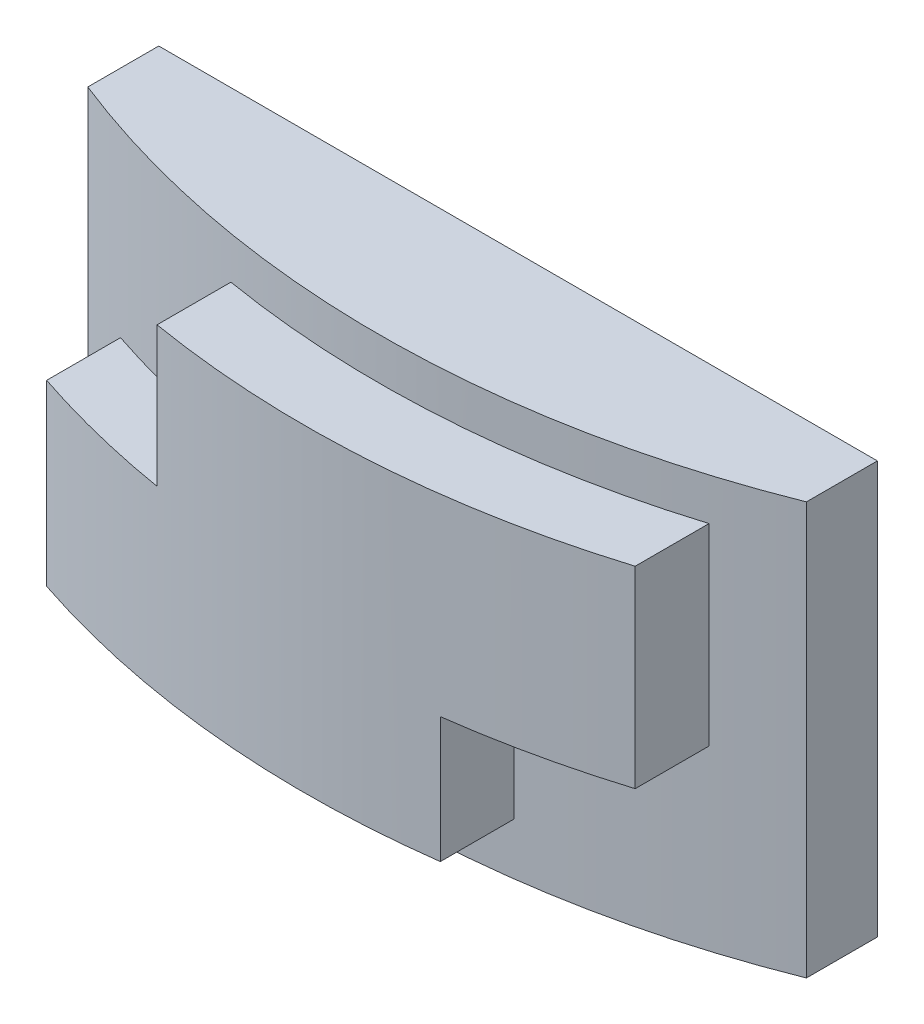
from build123d import *

# Parameters (mm, degrees)
EXTRUDE2_DEPTH        = 69.442801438
EXTRUDE8_REACH        = 146.507
EXTRUDE8_START_RADIUS = 163.850701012
EXTRUDE8_END_RADIUS   = 163.850701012


with BuildPart() as part:
    # Sketch2 → Extrude2 (new body)
    with BuildSketch(Plane(origin=(0, 0, 0), x_dir=(1, 0, 0), z_dir=(0, 1, 0))):
        with BuildLine():
            Line((-59.391176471, 0), (-59.391176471, 11.952941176))
            Line((-59.391176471, 11.952941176), (61.632352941, 11.952941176))
            Line((61.632352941, 11.952941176), (61.632352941, 0))
            ThreePointArc((61.632352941, 0), (1.120588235, -11.583243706), (-59.391176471, 0))
        make_face()
    extrude(amount=EXTRUDE2_DEPTH)

    # Extrude8: from a cylinder face, 146.507 long prism both ways, kept between that surface and its translate by the depth
    extrude8_start = Plane(origin=(1.120588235, 35.671659, -152.267457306), z_dir=(0, -1, 0)) * Cylinder(EXTRUDE8_START_RADIUS, 621.715402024, mode=Mode.PRIVATE)
    extrude8_end = Plane(origin=(1.120588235, 35.671659, -139.824655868), z_dir=(0, -1, 0)) * Cylinder(EXTRUDE8_END_RADIUS, 621.715402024, mode=Mode.PRIVATE)
    # Sketch3 → Extrude8 (add, from a surface)
    with BuildSketch(Plane.XY.offset(-82.33264686), mode=Mode.PRIVATE) as extrude8_sk1:
        Polygon((22.592394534, 8.760022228), (22.592394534, 29.910349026), (49.510992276, 29.910349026), (49.510992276, 62.35687309), (-25.957219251, 62.35687309), (-25.957219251, 38.803100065), (-50.712715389, 38.803100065), (-50.712715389, 8.760022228), align=None)
    extrude8_tool1 = extrude(extrude8_sk1.sketch, amount=EXTRUDE8_REACH, both=True, mode=Mode.PRIVATE)
    add(((extrude8_tool1 - extrude8_start) & extrude8_end).solids().sort_by_distance((-0.331965, 35.671659, 12.890822))[0])


solid = part.part
